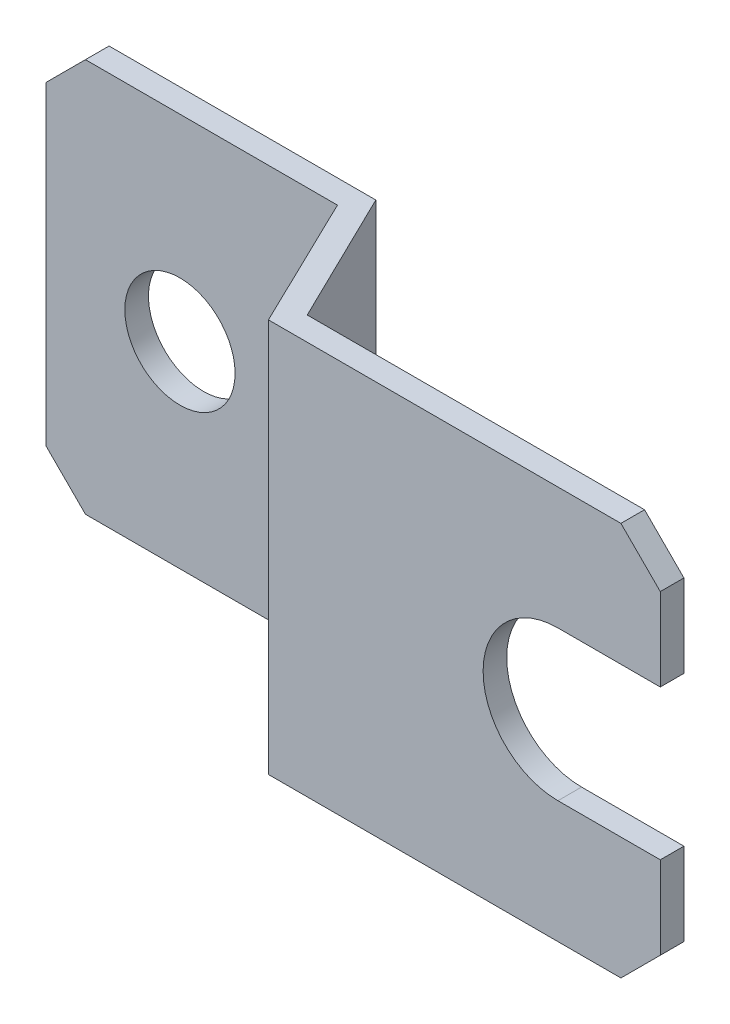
ISO-10303-21;
HEADER;
FILE_DESCRIPTION(('STEP AP214'),'2;1');
FILE_NAME('part.step','',(''),(''),'','','');
FILE_SCHEMA(('AUTOMOTIVE_DESIGN { 1 0 10303 214 1 1 1 1 }'));
ENDSEC;
DATA;
#1=APPLICATION_CONTEXT('core data for automotive mechanical design processes');
#2=APPLICATION_PROTOCOL_DEFINITION('international standard','automotive_design',2000,#1);
#3=PRODUCT_CONTEXT('',#1,'mechanical');
#4=PRODUCT('Part','Part','',(#3));
#5=PRODUCT_RELATED_PRODUCT_CATEGORY('part','',(#4));
#6=PRODUCT_DEFINITION_FORMATION('','',#4);
#7=PRODUCT_DEFINITION_CONTEXT('part definition',#1,'design');
#8=PRODUCT_DEFINITION('design','',#6,#7);
#9=PRODUCT_DEFINITION_SHAPE('','',#8);
#10=(LENGTH_UNIT() NAMED_UNIT(*) SI_UNIT(.MILLI.,.METRE.));
#11=(NAMED_UNIT(*) PLANE_ANGLE_UNIT() SI_UNIT($,.RADIAN.));
#12=(NAMED_UNIT(*) SI_UNIT($,.STERADIAN.) SOLID_ANGLE_UNIT());
#13=UNCERTAINTY_MEASURE_WITH_UNIT(LENGTH_MEASURE(1.E-05),#10,'distance_accuracy_value','');
#14=(GEOMETRIC_REPRESENTATION_CONTEXT(3) GLOBAL_UNCERTAINTY_ASSIGNED_CONTEXT((#13)) GLOBAL_UNIT_ASSIGNED_CONTEXT((#10,
#11,#12)) REPRESENTATION_CONTEXT('',''));
#15=CARTESIAN_POINT('',(0.,0.,0.));
#16=DIRECTION('',(0.,0.,1.));
#17=DIRECTION('',(1.,0.,0.));
#18=AXIS2_PLACEMENT_3D('',#15,#16,#17);
#19=CARTESIAN_POINT('',(78.,-25.,20.));
#20=DIRECTION('',(-1.,0.,0.));
#21=DIRECTION('',(0.,-1.,0.));
#22=AXIS2_PLACEMENT_3D('',#19,#20,#21);
#23=PLANE('',#22);
#24=DIRECTION('',(0.,1.,0.));
#25=VECTOR('',#24,1.);
#26=CARTESIAN_POINT('',(78.,-25.,17.));
#27=LINE('',#26,#25);
#28=CARTESIAN_POINT('',(78.,9.5,17.));
#29=VERTEX_POINT('',#28);
#30=CARTESIAN_POINT('',(78.,20.,17.));
#31=VERTEX_POINT('',#30);
#32=EDGE_CURVE('E219',#29,#31,#27,.T.);
#33=ORIENTED_EDGE('',*,*,#32,.T.);
#34=DIRECTION('',(0.,0.,1.));
#35=VECTOR('',#34,1.);
#36=CARTESIAN_POINT('',(78.,20.,-30.));
#37=LINE('',#36,#35);
#38=CARTESIAN_POINT('',(78.,20.,20.));
#39=VERTEX_POINT('',#38);
#40=EDGE_CURVE('E246',#31,#39,#37,.T.);
#41=ORIENTED_EDGE('',*,*,#40,.T.);
#42=DIRECTION('',(0.,1.,0.));
#43=VECTOR('',#42,1.);
#44=CARTESIAN_POINT('',(78.,-25.,20.));
#45=LINE('',#44,#43);
#46=CARTESIAN_POINT('',(78.,9.5,20.));
#47=VERTEX_POINT('',#46);
#48=EDGE_CURVE('E203',#47,#39,#45,.T.);
#49=ORIENTED_EDGE('',*,*,#48,.F.);
#50=DIRECTION('',(0.,0.,-1.));
#51=VECTOR('',#50,1.);
#52=CARTESIAN_POINT('',(78.,9.5,20.));
#53=LINE('',#52,#51);
#54=EDGE_CURVE('E165',#47,#29,#53,.T.);
#55=ORIENTED_EDGE('',*,*,#54,.T.);
#56=EDGE_LOOP('',(#33,#41,#49,#55));
#57=FACE_BOUND('',#56,.T.);
#58=ADVANCED_FACE('F14',(#57),#23,.F.);
#59=CARTESIAN_POINT('',(78.,-25.,20.));
#60=DIRECTION('',(0.,0.,-1.));
#61=DIRECTION('',(-1.,0.,0.));
#62=AXIS2_PLACEMENT_3D('',#59,#60,#61);
#63=PLANE('',#62);
#64=ORIENTED_EDGE('',*,*,#48,.T.);
#65=DIRECTION('',(0.707106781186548,-0.707106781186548,0.));
#66=VECTOR('',#65,1.);
#67=CARTESIAN_POINT('',(78.,20.,20.));
#68=LINE('',#67,#66);
#69=CARTESIAN_POINT('',(73.,25.,20.));
#70=VERTEX_POINT('',#69);
#71=EDGE_CURVE('E185',#70,#39,#68,.T.);
#72=ORIENTED_EDGE('',*,*,#71,.F.);
#73=DIRECTION('',(-1.,0.,0.));
#74=VECTOR('',#73,1.);
#75=CARTESIAN_POINT('',(78.,25.,20.));
#76=LINE('',#75,#74);
#77=CARTESIAN_POINT('',(28.237343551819,25.,20.));
#78=VERTEX_POINT('',#77);
#79=EDGE_CURVE('E204',#70,#78,#76,.T.);
#80=ORIENTED_EDGE('',*,*,#79,.T.);
#81=DIRECTION('',(0.,1.,0.));
#82=VECTOR('',#81,1.);
#83=CARTESIAN_POINT('',(28.237343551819,-25.,20.));
#84=LINE('',#83,#82);
#85=CARTESIAN_POINT('',(28.237343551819,-25.,20.));
#86=VERTEX_POINT('',#85);
#87=EDGE_CURVE('E154',#86,#78,#84,.T.);
#88=ORIENTED_EDGE('',*,*,#87,.F.);
#89=DIRECTION('',(-1.,0.,0.));
#90=VECTOR('',#89,1.);
#91=CARTESIAN_POINT('',(78.,-25.,20.));
#92=LINE('',#91,#90);
#93=CARTESIAN_POINT('',(73.,-25.,20.));
#94=VERTEX_POINT('',#93);
#95=EDGE_CURVE('E195',#94,#86,#92,.T.);
#96=ORIENTED_EDGE('',*,*,#95,.F.);
#97=DIRECTION('',(-0.707106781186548,-0.707106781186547,0.));
#98=VECTOR('',#97,1.);
#99=CARTESIAN_POINT('',(78.,-20.,20.));
#100=LINE('',#99,#98);
#101=CARTESIAN_POINT('',(78.,-20.,20.));
#102=VERTEX_POINT('',#101);
#103=EDGE_CURVE('E252',#102,#94,#100,.T.);
#104=ORIENTED_EDGE('',*,*,#103,.F.);
#105=CARTESIAN_POINT('',(78.,-9.5,20.));
#106=VERTEX_POINT('',#105);
#107=EDGE_CURVE('E217',#102,#106,#45,.T.);
#108=ORIENTED_EDGE('',*,*,#107,.T.);
#109=DIRECTION('',(-1.,0.,0.));
#110=VECTOR('',#109,1.);
#111=CARTESIAN_POINT('',(78.,-9.5,20.));
#112=LINE('',#111,#110);
#113=CARTESIAN_POINT('',(65.,-9.5,20.));
#114=VERTEX_POINT('',#113);
#115=EDGE_CURVE('E267',#106,#114,#112,.T.);
#116=ORIENTED_EDGE('',*,*,#115,.T.);
#117=CARTESIAN_POINT('',(65.,0.,20.));
#118=DIRECTION('',(0.,0.,-1.));
#119=DIRECTION('',(-1.,0.,0.));
#120=AXIS2_PLACEMENT_3D('',#117,#118,#119);
#121=CIRCLE('',#120,9.5);
#122=CARTESIAN_POINT('',(65.,9.5,20.));
#123=VERTEX_POINT('',#122);
#124=EDGE_CURVE('E162',#114,#123,#121,.T.);
#125=ORIENTED_EDGE('',*,*,#124,.T.);
#126=DIRECTION('',(1.,0.,0.));
#127=VECTOR('',#126,1.);
#128=CARTESIAN_POINT('',(78.,9.5,20.));
#129=LINE('',#128,#127);
#130=EDGE_CURVE('E273',#123,#47,#129,.T.);
#131=ORIENTED_EDGE('',*,*,#130,.T.);
#132=EDGE_LOOP('',(#64,#72,#80,#88,#96,#104,#108,#116,#125,#131));
#133=FACE_BOUND('',#132,.T.);
#134=ADVANCED_FACE('F16',(#133),#63,.F.);
#135=CARTESIAN_POINT('',(28.237343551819,-25.,20.));
#136=DIRECTION('',(0.899919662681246,0.,-0.436055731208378));
#137=DIRECTION('',(-0.436055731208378,0.,-0.899919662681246));
#138=AXIS2_PLACEMENT_3D('',#135,#136,#137);
#139=PLANE('',#138);
#140=DIRECTION('',(-0.436055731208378,0.,-0.899919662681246));
#141=VECTOR('',#140,1.);
#142=CARTESIAN_POINT('',(28.237343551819,25.,20.));
#143=LINE('',#142,#141);
#144=CARTESIAN_POINT('',(20.,25.,3.));
#145=VERTEX_POINT('',#144);
#146=EDGE_CURVE('E206',#78,#145,#143,.T.);
#147=ORIENTED_EDGE('',*,*,#146,.T.);
#148=DIRECTION('',(0.,1.,0.));
#149=VECTOR('',#148,1.);
#150=CARTESIAN_POINT('',(20.,-25.,3.));
#151=LINE('',#150,#149);
#152=CARTESIAN_POINT('',(20.,-25.,3.));
#153=VERTEX_POINT('',#152);
#154=EDGE_CURVE('E145',#153,#145,#151,.T.);
#155=ORIENTED_EDGE('',*,*,#154,.F.);
#156=DIRECTION('',(-0.436055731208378,0.,-0.899919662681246));
#157=VECTOR('',#156,1.);
#158=CARTESIAN_POINT('',(28.237343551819,-25.,20.));
#159=LINE('',#158,#157);
#160=EDGE_CURVE('E189',#86,#153,#159,.T.);
#161=ORIENTED_EDGE('',*,*,#160,.F.);
#162=ORIENTED_EDGE('',*,*,#87,.T.);
#163=EDGE_LOOP('',(#147,#155,#161,#162));
#164=FACE_BOUND('',#163,.T.);
#165=ADVANCED_FACE('F282',(#164),#139,.F.);
#166=CARTESIAN_POINT('',(20.,-25.,3.));
#167=DIRECTION('',(0.,0.,-1.));
#168=DIRECTION('',(-1.,0.,0.));
#169=AXIS2_PLACEMENT_3D('',#166,#167,#168);
#170=PLANE('',#169);
#171=CARTESIAN_POINT('',(0.,0.,3.));
#172=DIRECTION('',(0.,0.,-1.));
#173=DIRECTION('',(-1.,0.,0.));
#174=AXIS2_PLACEMENT_3D('',#171,#172,#173);
#175=CIRCLE('',#174,7.);
#176=CARTESIAN_POINT('',(-7.,0.,3.));
#177=VERTEX_POINT('',#176);
#178=EDGE_CURVE('E161',#177,#177,#175,.T.);
#179=ORIENTED_EDGE('',*,*,#178,.T.);
#180=EDGE_LOOP('',(#179));
#181=FACE_BOUND('',#180,.T.);
#182=DIRECTION('',(-1.,0.,0.));
#183=VECTOR('',#182,1.);
#184=CARTESIAN_POINT('',(20.,25.,3.));
#185=LINE('',#184,#183);
#186=CARTESIAN_POINT('',(-12.,25.,3.));
#187=VERTEX_POINT('',#186);
#188=EDGE_CURVE('E208',#145,#187,#185,.T.);
#189=ORIENTED_EDGE('',*,*,#188,.T.);
#190=DIRECTION('',(-0.707106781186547,-0.707106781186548,0.));
#191=VECTOR('',#190,1.);
#192=CARTESIAN_POINT('',(-21.,16.,3.));
#193=LINE('',#192,#191);
#194=CARTESIAN_POINT('',(-17.,20.,3.));
#195=VERTEX_POINT('',#194);
#196=EDGE_CURVE('E29',#187,#195,#193,.T.);
#197=ORIENTED_EDGE('',*,*,#196,.T.);
#198=DIRECTION('',(0.,1.,0.));
#199=VECTOR('',#198,1.);
#200=CARTESIAN_POINT('',(-17.,-25.,3.));
#201=LINE('',#200,#199);
#202=CARTESIAN_POINT('',(-17.,-20.,3.));
#203=VERTEX_POINT('',#202);
#204=EDGE_CURVE('E139',#203,#195,#201,.T.);
#205=ORIENTED_EDGE('',*,*,#204,.F.);
#206=DIRECTION('',(0.707106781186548,-0.707106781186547,0.));
#207=VECTOR('',#206,1.);
#208=CARTESIAN_POINT('',(4.,-41.,3.));
#209=LINE('',#208,#207);
#210=CARTESIAN_POINT('',(-12.,-25.,3.));
#211=VERTEX_POINT('',#210);
#212=EDGE_CURVE('E177',#203,#211,#209,.T.);
#213=ORIENTED_EDGE('',*,*,#212,.T.);
#214=DIRECTION('',(-1.,0.,0.));
#215=VECTOR('',#214,1.);
#216=CARTESIAN_POINT('',(20.,-25.,3.));
#217=LINE('',#216,#215);
#218=EDGE_CURVE('E184',#153,#211,#217,.T.);
#219=ORIENTED_EDGE('',*,*,#218,.F.);
#220=ORIENTED_EDGE('',*,*,#154,.T.);
#221=EDGE_LOOP('',(#189,#197,#205,#213,#219,#220));
#222=FACE_BOUND('',#221,.T.);
#223=ADVANCED_FACE('F183',(#181,#222),#170,.F.);
#224=CARTESIAN_POINT('',(-17.,-25.,3.));
#225=DIRECTION('',(1.,0.,0.));
#226=DIRECTION('',(0.,1.,0.));
#227=AXIS2_PLACEMENT_3D('',#224,#225,#226);
#228=PLANE('',#227);
#229=ORIENTED_EDGE('',*,*,#204,.T.);
#230=DIRECTION('',(0.,0.,1.));
#231=VECTOR('',#230,1.);
#232=CARTESIAN_POINT('',(-17.,20.,-30.));
#233=LINE('',#232,#231);
#234=CARTESIAN_POINT('',(-17.,20.,0.));
#235=VERTEX_POINT('',#234);
#236=EDGE_CURVE('E127',#235,#195,#233,.T.);
#237=ORIENTED_EDGE('',*,*,#236,.F.);
#238=DIRECTION('',(0.,1.,0.));
#239=VECTOR('',#238,1.);
#240=CARTESIAN_POINT('',(-17.,-25.,0.));
#241=LINE('',#240,#239);
#242=CARTESIAN_POINT('',(-17.,-20.,0.));
#243=VERTEX_POINT('',#242);
#244=EDGE_CURVE('E137',#243,#235,#241,.T.);
#245=ORIENTED_EDGE('',*,*,#244,.F.);
#246=DIRECTION('',(0.,0.,1.));
#247=VECTOR('',#246,1.);
#248=CARTESIAN_POINT('',(-17.,-20.,-30.));
#249=LINE('',#248,#247);
#250=EDGE_CURVE('E470',#243,#203,#249,.T.);
#251=ORIENTED_EDGE('',*,*,#250,.T.);
#252=EDGE_LOOP('',(#229,#237,#245,#251));
#253=FACE_BOUND('',#252,.T.);
#254=ADVANCED_FACE('F135',(#253),#228,.F.);
#255=CARTESIAN_POINT('',(21.8745969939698,-25.,0.));
#256=DIRECTION('',(0.,0.,1.));
#257=DIRECTION('',(1.,0.,0.));
#258=AXIS2_PLACEMENT_3D('',#255,#256,#257);
#259=PLANE('',#258);
#260=CARTESIAN_POINT('',(0.,0.,0.));
#261=DIRECTION('',(0.,0.,1.));
#262=DIRECTION('',(1.,0.,0.));
#263=AXIS2_PLACEMENT_3D('',#260,#261,#262);
#264=CIRCLE('',#263,7.);
#265=CARTESIAN_POINT('',(7.,0.,0.));
#266=VERTEX_POINT('',#265);
#267=EDGE_CURVE('E158',#266,#266,#264,.T.);
#268=ORIENTED_EDGE('',*,*,#267,.T.);
#269=EDGE_LOOP('',(#268));
#270=FACE_BOUND('',#269,.T.);
#271=ORIENTED_EDGE('',*,*,#244,.T.);
#272=DIRECTION('',(0.707106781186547,0.707106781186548,0.));
#273=VECTOR('',#272,1.);
#274=CARTESIAN_POINT('',(-20.0627015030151,16.9372984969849,0.));
#275=LINE('',#274,#273);
#276=CARTESIAN_POINT('',(-12.,25.,0.));
#277=VERTEX_POINT('',#276);
#278=EDGE_CURVE('E124',#235,#277,#275,.T.);
#279=ORIENTED_EDGE('',*,*,#278,.T.);
#280=DIRECTION('',(1.,0.,0.));
#281=VECTOR('',#280,1.);
#282=CARTESIAN_POINT('',(21.8745969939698,25.,0.));
#283=LINE('',#282,#281);
#284=CARTESIAN_POINT('',(21.8745969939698,25.,0.));
#285=VERTEX_POINT('',#284);
#286=EDGE_CURVE('E210',#277,#285,#283,.T.);
#287=ORIENTED_EDGE('',*,*,#286,.T.);
#288=DIRECTION('',(0.,1.,0.));
#289=VECTOR('',#288,1.);
#290=CARTESIAN_POINT('',(21.8745969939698,-25.,0.));
#291=LINE('',#290,#289);
#292=CARTESIAN_POINT('',(21.8745969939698,-25.,0.));
#293=VERTEX_POINT('',#292);
#294=EDGE_CURVE('E143',#293,#285,#291,.T.);
#295=ORIENTED_EDGE('',*,*,#294,.F.);
#296=DIRECTION('',(1.,0.,0.));
#297=VECTOR('',#296,1.);
#298=CARTESIAN_POINT('',(21.8745969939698,-25.,0.));
#299=LINE('',#298,#297);
#300=CARTESIAN_POINT('',(-12.,-25.,0.));
#301=VERTEX_POINT('',#300);
#302=EDGE_CURVE('E191',#301,#293,#299,.T.);
#303=ORIENTED_EDGE('',*,*,#302,.F.);
#304=DIRECTION('',(-0.707106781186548,0.707106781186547,0.));
#305=VECTOR('',#304,1.);
#306=CARTESIAN_POINT('',(4.9372984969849,-41.9372984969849,0.));
#307=LINE('',#306,#305);
#308=EDGE_CURVE('E36',#301,#243,#307,.T.);
#309=ORIENTED_EDGE('',*,*,#308,.T.);
#310=EDGE_LOOP('',(#271,#279,#287,#295,#303,#309));
#311=FACE_BOUND('',#310,.T.);
#312=ADVANCED_FACE('F141',(#270,#311),#259,.F.);
#313=CARTESIAN_POINT('',(30.1660509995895,-25.,17.));
#314=DIRECTION('',(-0.898794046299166,0.,0.43837114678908));
#315=DIRECTION('',(0.43837114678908,0.,0.898794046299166));
#316=AXIS2_PLACEMENT_3D('',#313,#314,#315);
#317=PLANE('',#316);
#318=DIRECTION('',(0.43837114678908,0.,0.898794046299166));
#319=VECTOR('',#318,1.);
#320=CARTESIAN_POINT('',(30.1660509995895,25.,17.));
#321=LINE('',#320,#319);
#322=CARTESIAN_POINT('',(30.1660509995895,25.,17.));
#323=VERTEX_POINT('',#322);
#324=EDGE_CURVE('E212',#285,#323,#321,.T.);
#325=ORIENTED_EDGE('',*,*,#324,.T.);
#326=DIRECTION('',(0.,1.,0.));
#327=VECTOR('',#326,1.);
#328=CARTESIAN_POINT('',(30.1660509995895,-25.,17.));
#329=LINE('',#328,#327);
#330=CARTESIAN_POINT('',(30.1660509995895,-25.,17.));
#331=VERTEX_POINT('',#330);
#332=EDGE_CURVE('E148',#331,#323,#329,.T.);
#333=ORIENTED_EDGE('',*,*,#332,.F.);
#334=DIRECTION('',(0.43837114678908,0.,0.898794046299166));
#335=VECTOR('',#334,1.);
#336=CARTESIAN_POINT('',(30.1660509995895,-25.,17.));
#337=LINE('',#336,#335);
#338=EDGE_CURVE('E193',#293,#331,#337,.T.);
#339=ORIENTED_EDGE('',*,*,#338,.F.);
#340=ORIENTED_EDGE('',*,*,#294,.T.);
#341=EDGE_LOOP('',(#325,#333,#339,#340));
#342=FACE_BOUND('',#341,.T.);
#343=ADVANCED_FACE('F285',(#342),#317,.F.);
#344=CARTESIAN_POINT('',(78.,-25.,17.));
#345=DIRECTION('',(0.,0.,1.));
#346=DIRECTION('',(1.,0.,0.));
#347=AXIS2_PLACEMENT_3D('',#344,#345,#346);
#348=PLANE('',#347);
#349=DIRECTION('',(1.,0.,0.));
#350=VECTOR('',#349,1.);
#351=CARTESIAN_POINT('',(78.,25.,17.));
#352=LINE('',#351,#350);
#353=CARTESIAN_POINT('',(73.,25.,17.));
#354=VERTEX_POINT('',#353);
#355=EDGE_CURVE('E214',#323,#354,#352,.T.);
#356=ORIENTED_EDGE('',*,*,#355,.T.);
#357=DIRECTION('',(0.707106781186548,-0.707106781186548,0.));
#358=VECTOR('',#357,1.);
#359=CARTESIAN_POINT('',(100.5,-2.5,17.));
#360=LINE('',#359,#358);
#361=EDGE_CURVE('E240',#354,#31,#360,.T.);
#362=ORIENTED_EDGE('',*,*,#361,.T.);
#363=ORIENTED_EDGE('',*,*,#32,.F.);
#364=DIRECTION('',(-1.,0.,0.));
#365=VECTOR('',#364,1.);
#366=CARTESIAN_POINT('',(78.,9.5,17.));
#367=LINE('',#366,#365);
#368=CARTESIAN_POINT('',(65.,9.5,17.));
#369=VERTEX_POINT('',#368);
#370=EDGE_CURVE('E270',#29,#369,#367,.T.);
#371=ORIENTED_EDGE('',*,*,#370,.T.);
#372=CARTESIAN_POINT('',(65.,0.,17.));
#373=DIRECTION('',(0.,0.,1.));
#374=DIRECTION('',(1.,0.,0.));
#375=AXIS2_PLACEMENT_3D('',#372,#373,#374);
#376=CIRCLE('',#375,9.5);
#377=CARTESIAN_POINT('',(65.,-9.5,17.));
#378=VERTEX_POINT('',#377);
#379=EDGE_CURVE('E168',#369,#378,#376,.T.);
#380=ORIENTED_EDGE('',*,*,#379,.T.);
#381=DIRECTION('',(1.,0.,0.));
#382=VECTOR('',#381,1.);
#383=CARTESIAN_POINT('',(78.,-9.5,17.));
#384=LINE('',#383,#382);
#385=CARTESIAN_POINT('',(78.,-9.5,17.));
#386=VERTEX_POINT('',#385);
#387=EDGE_CURVE('E262',#378,#386,#384,.T.);
#388=ORIENTED_EDGE('',*,*,#387,.T.);
#389=CARTESIAN_POINT('',(78.,-20.,17.));
#390=VERTEX_POINT('',#389);
#391=EDGE_CURVE('E220',#390,#386,#27,.T.);
#392=ORIENTED_EDGE('',*,*,#391,.F.);
#393=DIRECTION('',(-0.707106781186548,-0.707106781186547,0.));
#394=VECTOR('',#393,1.);
#395=CARTESIAN_POINT('',(75.5,-22.5,17.));
#396=LINE('',#395,#394);
#397=CARTESIAN_POINT('',(73.,-25.,17.));
#398=VERTEX_POINT('',#397);
#399=EDGE_CURVE('E256',#390,#398,#396,.T.);
#400=ORIENTED_EDGE('',*,*,#399,.T.);
#401=DIRECTION('',(1.,0.,0.));
#402=VECTOR('',#401,1.);
#403=CARTESIAN_POINT('',(78.,-25.,17.));
#404=LINE('',#403,#402);
#405=EDGE_CURVE('E200',#331,#398,#404,.T.);
#406=ORIENTED_EDGE('',*,*,#405,.F.);
#407=ORIENTED_EDGE('',*,*,#332,.T.);
#408=EDGE_LOOP('',(#356,#362,#363,#371,#380,#388,#392,#400,#406,#407));
#409=FACE_BOUND('',#408,.T.);
#410=ADVANCED_FACE('F226',(#409),#348,.F.);
#411=ORIENTED_EDGE('',*,*,#107,.F.);
#412=DIRECTION('',(0.,0.,1.));
#413=VECTOR('',#412,1.);
#414=CARTESIAN_POINT('',(78.,-20.,-30.));
#415=LINE('',#414,#413);
#416=EDGE_CURVE('E254',#390,#102,#415,.T.);
#417=ORIENTED_EDGE('',*,*,#416,.F.);
#418=ORIENTED_EDGE('',*,*,#391,.T.);
#419=DIRECTION('',(0.,0.,1.));
#420=VECTOR('',#419,1.);
#421=CARTESIAN_POINT('',(78.,-9.5,20.));
#422=LINE('',#421,#420);
#423=EDGE_CURVE('E157',#386,#106,#422,.T.);
#424=ORIENTED_EDGE('',*,*,#423,.T.);
#425=EDGE_LOOP('',(#411,#417,#418,#424));
#426=FACE_BOUND('',#425,.T.);
#427=ADVANCED_FACE('F294',(#426),#23,.F.);
#428=CARTESIAN_POINT('',(-17.,-25.,0.));
#429=DIRECTION('',(0.,-1.,0.));
#430=DIRECTION('',(1.,0.,0.));
#431=AXIS2_PLACEMENT_3D('',#428,#429,#430);
#432=PLANE('',#431);
#433=DIRECTION('',(0.,0.,1.));
#434=VECTOR('',#433,1.);
#435=CARTESIAN_POINT('',(-12.,-25.,0.));
#436=LINE('',#435,#434);
#437=EDGE_CURVE('E22',#301,#211,#436,.T.);
#438=ORIENTED_EDGE('',*,*,#437,.F.);
#439=ORIENTED_EDGE('',*,*,#302,.T.);
#440=ORIENTED_EDGE('',*,*,#338,.T.);
#441=ORIENTED_EDGE('',*,*,#405,.T.);
#442=DIRECTION('',(0.,0.,-1.));
#443=VECTOR('',#442,1.);
#444=CARTESIAN_POINT('',(73.,-25.,0.));
#445=LINE('',#444,#443);
#446=EDGE_CURVE('E171',#94,#398,#445,.T.);
#447=ORIENTED_EDGE('',*,*,#446,.F.);
#448=ORIENTED_EDGE('',*,*,#95,.T.);
#449=ORIENTED_EDGE('',*,*,#160,.T.);
#450=ORIENTED_EDGE('',*,*,#218,.T.);
#451=EDGE_LOOP('',(#438,#439,#440,#441,#447,#448,#449,#450));
#452=FACE_BOUND('',#451,.T.);
#453=ADVANCED_FACE('F187',(#452),#432,.T.);
#454=CARTESIAN_POINT('',(-17.,25.,0.));
#455=DIRECTION('',(0.,-1.,0.));
#456=DIRECTION('',(1.,0.,0.));
#457=AXIS2_PLACEMENT_3D('',#454,#455,#456);
#458=PLANE('',#457);
#459=ORIENTED_EDGE('',*,*,#286,.F.);
#460=DIRECTION('',(0.,0.,1.));
#461=VECTOR('',#460,1.);
#462=CARTESIAN_POINT('',(-12.,25.,0.));
#463=LINE('',#462,#461);
#464=EDGE_CURVE('E9',#277,#187,#463,.T.);
#465=ORIENTED_EDGE('',*,*,#464,.T.);
#466=ORIENTED_EDGE('',*,*,#188,.F.);
#467=ORIENTED_EDGE('',*,*,#146,.F.);
#468=ORIENTED_EDGE('',*,*,#79,.F.);
#469=DIRECTION('',(0.,0.,-1.));
#470=VECTOR('',#469,1.);
#471=CARTESIAN_POINT('',(73.,25.,0.));
#472=LINE('',#471,#470);
#473=EDGE_CURVE('E173',#70,#354,#472,.T.);
#474=ORIENTED_EDGE('',*,*,#473,.T.);
#475=ORIENTED_EDGE('',*,*,#355,.F.);
#476=ORIENTED_EDGE('',*,*,#324,.F.);
#477=EDGE_LOOP('',(#459,#465,#466,#467,#468,#474,#475,#476));
#478=FACE_BOUND('',#477,.T.);
#479=ADVANCED_FACE('F233',(#478),#458,.F.);
#480=CARTESIAN_POINT('',(0.,0.,-22.));
#481=DIRECTION('',(0.,0.,1.));
#482=DIRECTION('',(1.,0.,0.));
#483=AXIS2_PLACEMENT_3D('',#480,#481,#482);
#484=CYLINDRICAL_SURFACE('',#483,7.);
#485=ORIENTED_EDGE('',*,*,#267,.F.);
#486=EDGE_LOOP('',(#485));
#487=FACE_BOUND('',#486,.T.);
#488=ORIENTED_EDGE('',*,*,#178,.F.);
#489=EDGE_LOOP('',(#488));
#490=FACE_BOUND('',#489,.T.);
#491=ADVANCED_FACE('F337',(#487,#490),#484,.F.);
#492=CARTESIAN_POINT('',(65.,0.,-22.));
#493=DIRECTION('',(0.,0.,1.));
#494=DIRECTION('',(1.,0.,0.));
#495=AXIS2_PLACEMENT_3D('',#492,#493,#494);
#496=CYLINDRICAL_SURFACE('',#495,9.5);
#497=DIRECTION('',(0.,0.,1.));
#498=VECTOR('',#497,1.);
#499=CARTESIAN_POINT('',(65.,-9.5,-22.));
#500=LINE('',#499,#498);
#501=EDGE_CURVE('E258',#378,#114,#500,.T.);
#502=ORIENTED_EDGE('',*,*,#501,.F.);
#503=ORIENTED_EDGE('',*,*,#379,.F.);
#504=DIRECTION('',(0.,0.,1.));
#505=VECTOR('',#504,1.);
#506=CARTESIAN_POINT('',(65.,9.5,-22.));
#507=LINE('',#506,#505);
#508=EDGE_CURVE('E259',#369,#123,#507,.T.);
#509=ORIENTED_EDGE('',*,*,#508,.T.);
#510=ORIENTED_EDGE('',*,*,#124,.F.);
#511=EDGE_LOOP('',(#502,#503,#509,#510));
#512=FACE_BOUND('',#511,.T.);
#513=ADVANCED_FACE('F323',(#512),#496,.F.);
#514=CARTESIAN_POINT('',(86.1837482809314,9.5,-22.));
#515=DIRECTION('',(0.,1.,0.));
#516=DIRECTION('',(-1.,0.,0.));
#517=AXIS2_PLACEMENT_3D('',#514,#515,#516);
#518=PLANE('',#517);
#519=ORIENTED_EDGE('',*,*,#508,.F.);
#520=ORIENTED_EDGE('',*,*,#370,.F.);
#521=ORIENTED_EDGE('',*,*,#54,.F.);
#522=ORIENTED_EDGE('',*,*,#130,.F.);
#523=EDGE_LOOP('',(#519,#520,#521,#522));
#524=FACE_BOUND('',#523,.T.);
#525=ADVANCED_FACE('F327',(#524),#518,.F.);
#526=CARTESIAN_POINT('',(65.,-9.5,-22.));
#527=DIRECTION('',(0.,-1.,0.));
#528=DIRECTION('',(1.,0.,0.));
#529=AXIS2_PLACEMENT_3D('',#526,#527,#528);
#530=PLANE('',#529);
#531=ORIENTED_EDGE('',*,*,#423,.F.);
#532=ORIENTED_EDGE('',*,*,#387,.F.);
#533=ORIENTED_EDGE('',*,*,#501,.T.);
#534=ORIENTED_EDGE('',*,*,#115,.F.);
#535=EDGE_LOOP('',(#531,#532,#533,#534));
#536=FACE_BOUND('',#535,.T.);
#537=ADVANCED_FACE('F320',(#536),#530,.F.);
#538=CARTESIAN_POINT('',(78.,-20.,-30.));
#539=DIRECTION('',(-0.707106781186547,0.707106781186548,0.));
#540=DIRECTION('',(-0.707106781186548,-0.707106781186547,0.));
#541=AXIS2_PLACEMENT_3D('',#538,#539,#540);
#542=PLANE('',#541);
#543=ORIENTED_EDGE('',*,*,#416,.T.);
#544=ORIENTED_EDGE('',*,*,#103,.T.);
#545=ORIENTED_EDGE('',*,*,#446,.T.);
#546=ORIENTED_EDGE('',*,*,#399,.F.);
#547=EDGE_LOOP('',(#543,#544,#545,#546));
#548=FACE_BOUND('',#547,.T.);
#549=ADVANCED_FACE('F335',(#548),#542,.F.);
#550=CARTESIAN_POINT('',(78.,20.,-30.));
#551=DIRECTION('',(-0.707106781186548,-0.707106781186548,0.));
#552=DIRECTION('',(0.707106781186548,-0.707106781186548,0.));
#553=AXIS2_PLACEMENT_3D('',#550,#551,#552);
#554=PLANE('',#553);
#555=ORIENTED_EDGE('',*,*,#473,.F.);
#556=ORIENTED_EDGE('',*,*,#71,.T.);
#557=ORIENTED_EDGE('',*,*,#40,.F.);
#558=ORIENTED_EDGE('',*,*,#361,.F.);
#559=EDGE_LOOP('',(#555,#556,#557,#558));
#560=FACE_BOUND('',#559,.T.);
#561=ADVANCED_FACE('F238',(#560),#554,.F.);
#562=CARTESIAN_POINT('',(-17.,-20.,-30.));
#563=DIRECTION('',(0.707106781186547,0.707106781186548,0.));
#564=DIRECTION('',(-0.707106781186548,0.707106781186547,0.));
#565=AXIS2_PLACEMENT_3D('',#562,#563,#564);
#566=PLANE('',#565);
#567=ORIENTED_EDGE('',*,*,#250,.F.);
#568=ORIENTED_EDGE('',*,*,#308,.F.);
#569=ORIENTED_EDGE('',*,*,#437,.T.);
#570=ORIENTED_EDGE('',*,*,#212,.F.);
#571=EDGE_LOOP('',(#567,#568,#569,#570));
#572=FACE_BOUND('',#571,.T.);
#573=ADVANCED_FACE('F176',(#572),#566,.F.);
#574=CARTESIAN_POINT('',(-17.,20.,-30.));
#575=DIRECTION('',(0.707106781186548,-0.707106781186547,0.));
#576=DIRECTION('',(0.707106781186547,0.707106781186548,0.));
#577=AXIS2_PLACEMENT_3D('',#574,#575,#576);
#578=PLANE('',#577);
#579=ORIENTED_EDGE('',*,*,#464,.F.);
#580=ORIENTED_EDGE('',*,*,#278,.F.);
#581=ORIENTED_EDGE('',*,*,#236,.T.);
#582=ORIENTED_EDGE('',*,*,#196,.F.);
#583=EDGE_LOOP('',(#579,#580,#581,#582));
#584=FACE_BOUND('',#583,.T.);
#585=ADVANCED_FACE('F126',(#584),#578,.F.);
#586=CLOSED_SHELL('',(#58,#134,#165,#223,#254,#312,#343,#410,#427,#453,#479,#491,#513,#525,#537,
#549,#561,#573,#585));
#587=MANIFOLD_SOLID_BREP('B1',#586);
#588=ADVANCED_BREP_SHAPE_REPRESENTATION('',(#18,#587),#14);
#589=SHAPE_DEFINITION_REPRESENTATION(#9,#588);
ENDSEC;
END-ISO-10303-21;
